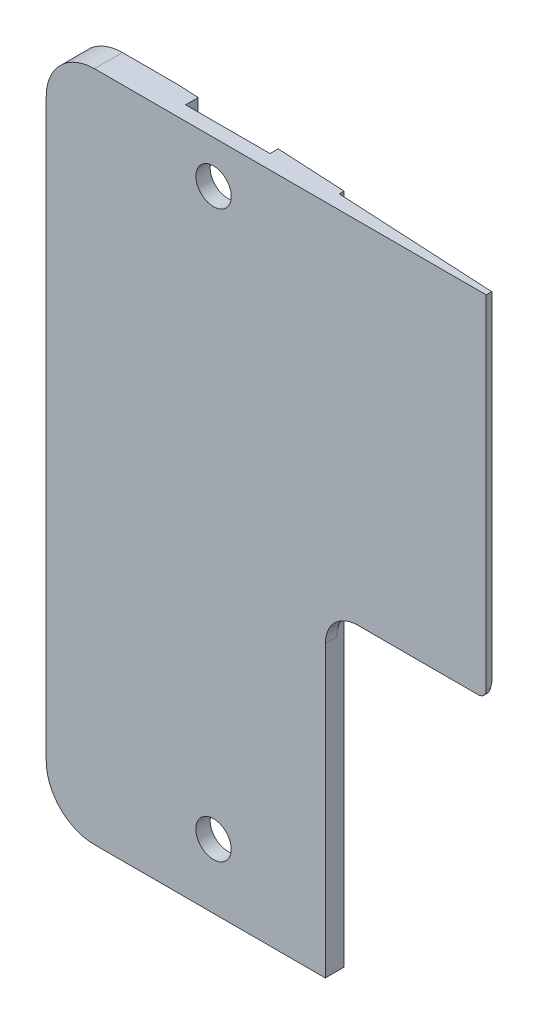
ISO-10303-21;
HEADER;
FILE_DESCRIPTION(('STEP AP214'),'2;1');
FILE_NAME('part.step','',(''),(''),'','','');
FILE_SCHEMA(('AUTOMOTIVE_DESIGN { 1 0 10303 214 1 1 1 1 }'));
ENDSEC;
DATA;
#1=APPLICATION_CONTEXT('core data for automotive mechanical design processes');
#2=APPLICATION_PROTOCOL_DEFINITION('international standard','automotive_design',2000,#1);
#3=PRODUCT_CONTEXT('',#1,'mechanical');
#4=PRODUCT('Part','Part','',(#3));
#5=PRODUCT_RELATED_PRODUCT_CATEGORY('part','',(#4));
#6=PRODUCT_DEFINITION_FORMATION('','',#4);
#7=PRODUCT_DEFINITION_CONTEXT('part definition',#1,'design');
#8=PRODUCT_DEFINITION('design','',#6,#7);
#9=PRODUCT_DEFINITION_SHAPE('','',#8);
#10=(LENGTH_UNIT() NAMED_UNIT(*) SI_UNIT(.MILLI.,.METRE.));
#11=(NAMED_UNIT(*) PLANE_ANGLE_UNIT() SI_UNIT($,.RADIAN.));
#12=(NAMED_UNIT(*) SI_UNIT($,.STERADIAN.) SOLID_ANGLE_UNIT());
#13=UNCERTAINTY_MEASURE_WITH_UNIT(LENGTH_MEASURE(1.E-05),#10,'distance_accuracy_value','');
#14=(GEOMETRIC_REPRESENTATION_CONTEXT(3) GLOBAL_UNCERTAINTY_ASSIGNED_CONTEXT((#13)) GLOBAL_UNIT_ASSIGNED_CONTEXT((#10,
#11,#12)) REPRESENTATION_CONTEXT('',''));
#15=CARTESIAN_POINT('',(0.,0.,0.));
#16=DIRECTION('',(0.,0.,1.));
#17=DIRECTION('',(1.,0.,0.));
#18=AXIS2_PLACEMENT_3D('',#15,#16,#17);
#19=CARTESIAN_POINT('',(0.,-128.652153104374,-6.7));
#20=DIRECTION('',(0.,0.,-1.));
#21=DIRECTION('',(-1.,0.,0.));
#22=AXIS2_PLACEMENT_3D('',#19,#20,#21);
#23=PLANE('',#22);
#24=CARTESIAN_POINT('',(4.64896534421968,-57.3698033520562,-6.7));
#25=DIRECTION('',(0.,0.,1.));
#26=DIRECTION('',(1.,0.,0.));
#27=AXIS2_PLACEMENT_3D('',#24,#25,#26);
#28=CIRCLE('',#27,3.);
#29=CARTESIAN_POINT('',(4.64896534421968,-54.3698033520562,-6.7));
#30=VERTEX_POINT('',#29);
#31=CARTESIAN_POINT('',(1.64896534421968,-57.3698033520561,-6.7));
#32=VERTEX_POINT('',#31);
#33=EDGE_CURVE('E202',#30,#32,#28,.T.);
#34=ORIENTED_EDGE('',*,*,#33,.F.);
#35=DIRECTION('',(-1.,0.,0.));
#36=VECTOR('',#35,1.);
#37=CARTESIAN_POINT('',(4.64896534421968,-54.3698033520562,-6.7));
#38=LINE('',#37,#36);
#39=CARTESIAN_POINT('',(8.13491967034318,-54.3698033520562,-6.70000000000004));
#40=VERTEX_POINT('',#39);
#41=EDGE_CURVE('E213',#40,#30,#38,.T.);
#42=ORIENTED_EDGE('',*,*,#41,.F.);
#43=DIRECTION('',(0.,1.,0.));
#44=VECTOR('',#43,1.);
#45=CARTESIAN_POINT('',(8.13491967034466,-128.652153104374,-6.7));
#46=LINE('',#45,#44);
#47=CARTESIAN_POINT('',(8.13491967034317,-96.15,-6.70000000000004));
#48=VERTEX_POINT('',#47);
#49=EDGE_CURVE('E245',#48,#40,#46,.T.);
#50=ORIENTED_EDGE('',*,*,#49,.F.);
#51=DIRECTION('',(1.,0.,0.));
#52=VECTOR('',#51,1.);
#53=CARTESIAN_POINT('',(4.64896534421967,-96.15,-6.7));
#54=LINE('',#53,#52);
#55=CARTESIAN_POINT('',(4.64896534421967,-96.15,-6.7));
#56=VERTEX_POINT('',#55);
#57=EDGE_CURVE('E211',#56,#48,#54,.T.);
#58=ORIENTED_EDGE('',*,*,#57,.F.);
#59=CARTESIAN_POINT('',(4.64896534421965,-93.15,-6.7));
#60=DIRECTION('',(0.,0.,1.));
#61=DIRECTION('',(-1.,0.,0.));
#62=AXIS2_PLACEMENT_3D('',#59,#60,#61);
#63=CIRCLE('',#62,3.);
#64=CARTESIAN_POINT('',(1.64896534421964,-93.15,-6.7));
#65=VERTEX_POINT('',#64);
#66=EDGE_CURVE('E208',#65,#56,#63,.T.);
#67=ORIENTED_EDGE('',*,*,#66,.F.);
#68=DIRECTION('',(0.,-1.,0.));
#69=VECTOR('',#68,1.);
#70=CARTESIAN_POINT('',(1.64896534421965,-93.15,-6.7));
#71=LINE('',#70,#69);
#72=EDGE_CURVE('E205',#32,#65,#71,.T.);
#73=ORIENTED_EDGE('',*,*,#72,.F.);
#74=EDGE_LOOP('',(#34,#42,#50,#58,#67,#73));
#75=FACE_BOUND('',#74,.T.);
#76=ADVANCED_FACE('F37',(#75),#23,.T.);
#77=CARTESIAN_POINT('',(19.,-128.652153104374,-6.13058526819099));
#78=DIRECTION('',(0.0523359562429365,0.,-0.998629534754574));
#79=DIRECTION('',(-0.998629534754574,0.,-0.0523359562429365));
#80=AXIS2_PLACEMENT_3D('',#77,#78,#79);
#81=PLANE('',#80);
#82=CARTESIAN_POINT('',(12.05,-92.15,-6.49481933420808));
#83=DIRECTION('',(0.0523359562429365,0.,-0.998629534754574));
#84=DIRECTION('',(-0.998629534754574,0.,-0.0523359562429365));
#85=AXIS2_PLACEMENT_3D('',#82,#83,#84);
#86=ELLIPSE('',#85,2.62860240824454,2.625);
#87=CARTESIAN_POINT('',(9.42500000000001,-92.15,-6.63238975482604));
#88=VERTEX_POINT('',#87);
#89=EDGE_CURVE('E201',#88,#88,#86,.T.);
#90=ORIENTED_EDGE('',*,*,#89,.F.);
#91=EDGE_LOOP('',(#90));
#92=FACE_BOUND('',#91,.T.);
#93=DIRECTION('',(0.,-1.,0.));
#94=VECTOR('',#93,1.);
#95=CARTESIAN_POINT('',(14.675,-128.652153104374,-6.35724891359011));
#96=LINE('',#95,#94);
#97=CARTESIAN_POINT('',(14.675,-54.3698033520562,-6.35724891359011));
#98=VERTEX_POINT('',#97);
#99=CARTESIAN_POINT('',(14.675,-57.,-6.35724891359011));
#100=VERTEX_POINT('',#99);
#101=EDGE_CURVE('E199',#98,#100,#96,.T.);
#102=ORIENTED_EDGE('',*,*,#101,.F.);
#103=DIRECTION('',(0.998629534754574,0.,0.0523359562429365));
#104=VECTOR('',#103,1.);
#105=CARTESIAN_POINT('',(19.,-54.3698033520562,-6.13058526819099));
#106=LINE('',#105,#104);
#107=CARTESIAN_POINT('',(19.,-54.3698033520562,-6.13058526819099));
#108=VERTEX_POINT('',#107);
#109=EDGE_CURVE('E240',#98,#108,#106,.T.);
#110=ORIENTED_EDGE('',*,*,#109,.T.);
#111=DIRECTION('',(0.,1.,0.));
#112=VECTOR('',#111,1.);
#113=CARTESIAN_POINT('',(19.,-128.652153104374,-6.13058526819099));
#114=LINE('',#113,#112);
#115=CARTESIAN_POINT('',(19.,-96.15,-6.13058526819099));
#116=VERTEX_POINT('',#115);
#117=EDGE_CURVE('E249',#116,#108,#114,.T.);
#118=ORIENTED_EDGE('',*,*,#117,.F.);
#119=DIRECTION('',(-0.998629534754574,0.,-0.0523359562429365));
#120=VECTOR('',#119,1.);
#121=CARTESIAN_POINT('',(19.,-96.15,-6.13058526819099));
#122=LINE('',#121,#120);
#123=EDGE_CURVE('E219',#116,#48,#122,.T.);
#124=ORIENTED_EDGE('',*,*,#123,.T.);
#125=ORIENTED_EDGE('',*,*,#49,.T.);
#126=CARTESIAN_POINT('',(9.42500000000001,-54.3698033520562,-6.63238975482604));
#127=VERTEX_POINT('',#126);
#128=EDGE_CURVE('E241',#40,#127,#106,.T.);
#129=ORIENTED_EDGE('',*,*,#128,.T.);
#130=DIRECTION('',(0.,1.,0.));
#131=VECTOR('',#130,1.);
#132=CARTESIAN_POINT('',(9.42500000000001,-128.652153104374,-6.63238975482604));
#133=LINE('',#132,#131);
#134=CARTESIAN_POINT('',(9.42500000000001,-57.,-6.63238975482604));
#135=VERTEX_POINT('',#134);
#136=EDGE_CURVE('E197',#135,#127,#133,.T.);
#137=ORIENTED_EDGE('',*,*,#136,.F.);
#138=CARTESIAN_POINT('',(12.05,-57.,-6.49481933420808));
#139=DIRECTION('',(0.0523359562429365,0.,-0.998629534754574));
#140=DIRECTION('',(-0.998629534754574,0.,-0.0523359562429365));
#141=AXIS2_PLACEMENT_3D('',#138,#139,#140);
#142=ELLIPSE('',#141,2.62860240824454,2.625);
#143=EDGE_CURVE('E165',#100,#135,#142,.T.);
#144=ORIENTED_EDGE('',*,*,#143,.F.);
#145=EDGE_LOOP('',(#102,#110,#118,#124,#125,#129,#137,#144));
#146=FACE_BOUND('',#145,.T.);
#147=ADVANCED_FACE('F388',(#92,#146),#81,.T.);
#148=CARTESIAN_POINT('',(19.,-128.652153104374,-6.13058526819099));
#149=DIRECTION('',(1.,0.,0.));
#150=DIRECTION('',(0.,0.,-1.));
#151=AXIS2_PLACEMENT_3D('',#148,#149,#150);
#152=PLANE('',#151);
#153=DIRECTION('',(0.,1.,0.));
#154=VECTOR('',#153,1.);
#155=CARTESIAN_POINT('',(19.,-128.652153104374,-5.83017356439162));
#156=LINE('',#155,#154);
#157=CARTESIAN_POINT('',(19.,-76.2789600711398,-5.83017356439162));
#158=VERTEX_POINT('',#157);
#159=CARTESIAN_POINT('',(19.,-54.3698033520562,-5.83017356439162));
#160=VERTEX_POINT('',#159);
#161=EDGE_CURVE('E252',#158,#160,#156,.T.);
#162=ORIENTED_EDGE('',*,*,#161,.F.);
#163=CARTESIAN_POINT('',(19.,-78.1500000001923,-5.66901754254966));
#164=CARTESIAN_POINT('',(19.0000017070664,-78.1238909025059,-5.66901732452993));
#165=CARTESIAN_POINT('',(19.0000035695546,-78.0977818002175,-5.6691189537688));
#166=CARTESIAN_POINT('',(19.0000057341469,-78.0455902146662,-5.66952589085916));
#167=CARTESIAN_POINT('',(19.0000060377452,-78.0195077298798,-5.66983100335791));
#168=CARTESIAN_POINT('',(19.0000032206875,-77.9672888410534,-5.67064578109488));
#169=CARTESIAN_POINT('',(19.0000000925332,-77.9411524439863,-5.67115589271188));
#170=CARTESIAN_POINT('',(18.9999999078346,-77.8889882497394,-5.67237537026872));
#171=CARTESIAN_POINT('',(19.0000028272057,-77.8629604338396,-5.67308393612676));
#172=CARTESIAN_POINT('',(19.0000055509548,-77.8108697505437,-5.67470328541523));
#173=CARTESIAN_POINT('',(19.0000053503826,-77.784806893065,-5.67561438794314));
#174=CARTESIAN_POINT('',(19.0000026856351,-77.7325737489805,-5.67764076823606));
#175=CARTESIAN_POINT('',(19.0000002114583,-77.7064034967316,-5.67875693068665));
#176=CARTESIAN_POINT('',(18.9999997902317,-77.6542813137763,-5.68117742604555));
#177=CARTESIAN_POINT('',(19.0000018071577,-77.6283293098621,-5.68248018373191));
#178=CARTESIAN_POINT('',(19.0000036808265,-77.5763316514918,-5.685285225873));
#179=CARTESIAN_POINT('',(19.0000035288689,-77.5502860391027,-5.68678828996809));
#180=CARTESIAN_POINT('',(19.0000017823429,-77.4980425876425,-5.68999696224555));
#181=CARTESIAN_POINT('',(19.0000001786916,-77.4718448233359,-5.69170378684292));
#182=CARTESIAN_POINT('',(18.9999998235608,-77.4197925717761,-5.69528535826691));
#183=CARTESIAN_POINT('',(19.0000010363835,-77.3939379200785,-5.69715771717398));
#184=CARTESIAN_POINT('',(19.0000021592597,-77.3420660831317,-5.70109896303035));
#185=CARTESIAN_POINT('',(19.0000020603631,-77.3160489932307,-5.70316910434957));
#186=CARTESIAN_POINT('',(19.0000010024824,-77.2638082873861,-5.70750926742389));
#187=CARTESIAN_POINT('',(19.0000000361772,-77.2375848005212,-5.70978084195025));
#188=CARTESIAN_POINT('',(18.9999999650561,-77.186047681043,-5.7144229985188));
#189=CARTESIAN_POINT('',(19.000000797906,-77.1607335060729,-5.71678756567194));
#190=CARTESIAN_POINT('',(19.000002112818,-77.1098872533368,-5.72170274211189));
#191=CARTESIAN_POINT('',(19.0000025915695,-77.0843553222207,-5.72425486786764));
#192=CARTESIAN_POINT('',(19.000002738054,-77.0330438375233,-5.72954817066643));
#193=CARTESIAN_POINT('',(19.0000023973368,-77.0072644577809,-5.73229103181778));
#194=CARTESIAN_POINT('',(19.0000016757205,-76.9554309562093,-5.73796870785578));
#195=CARTESIAN_POINT('',(19.0000012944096,-76.9293770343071,-5.74090534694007));
#196=CARTESIAN_POINT('',(19.0000006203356,-76.8769694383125,-5.74697346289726));
#197=CARTESIAN_POINT('',(19.0000003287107,-76.8506159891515,-5.75010688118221));
#198=CARTESIAN_POINT('',(19.0000002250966,-76.7975863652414,-5.75657121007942));
#199=CARTESIAN_POINT('',(19.0000004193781,-76.7709104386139,-5.75990415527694));
#200=CARTESIAN_POINT('',(18.9999996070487,-76.7192586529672,-5.76650932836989));
#201=CARTESIAN_POINT('',(18.9999986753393,-76.6942815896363,-5.76977214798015));
#202=CARTESIAN_POINT('',(18.999996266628,-76.6439958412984,-5.7764745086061));
#203=CARTESIAN_POINT('',(18.9999947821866,-76.6186874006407,-5.77991588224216));
#204=CARTESIAN_POINT('',(18.9999927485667,-76.5677247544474,-5.78697716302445));
#205=CARTESIAN_POINT('',(18.9999922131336,-76.5420708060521,-5.79059892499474));
#206=CARTESIAN_POINT('',(18.9999922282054,-76.4904043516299,-5.79802286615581));
#207=CARTESIAN_POINT('',(18.9999927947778,-76.4643921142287,-5.80182691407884));
#208=CARTESIAN_POINT('',(18.999994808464,-76.4119978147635,-5.80961717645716));
#209=CARTESIAN_POINT('',(18.9999962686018,-76.3856160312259,-5.81360526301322));
#210=CARTESIAN_POINT('',(18.9999987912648,-76.3324728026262,-5.82176537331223));
#211=CARTESIAN_POINT('',(18.9999998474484,-76.3057116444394,-5.82593926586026));
#212=CARTESIAN_POINT('',(19.0000000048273,-76.2789600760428,-5.83017356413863));
#213=B_SPLINE_CURVE_WITH_KNOTS('',3,(#163,#164,#165,#166,#167,#168,#169,#170,#171,#172,#173,
#174,#175,#176,#177,#178,#179,#180,#181,#182,#183,#184,#185,#186,#187,#188,#189,#190,#191,#192,
#193,#194,#195,#196,#197,#198,#199,#200,#201,#202,#203,#204,#205,#206,#207,#208,#209,#210,#211,
#212),.UNSPECIFIED.,.F.,.F.,(4,2,2,2,2,2,2,2,2,2,2,2,2,2,2,2,2,2,2,2,2,2,2,2,4),(0.,
0.0783271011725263,0.156579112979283,0.235002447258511,0.313114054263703,0.391349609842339,
0.469930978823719,0.547884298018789,0.626150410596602,0.704909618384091,0.782676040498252,
0.860973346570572,0.939937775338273,1.01621034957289,1.09318731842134,1.17096146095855,
1.24961765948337,1.32923440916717,1.40988393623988,1.48545141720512,1.56207510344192,
1.63979980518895,1.71866624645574,1.7987105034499,1.87996428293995),.UNSPECIFIED.);
#214=CARTESIAN_POINT('',(19.,-78.15,-5.66901679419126));
#215=VERTEX_POINT('',#214);
#216=EDGE_CURVE('E325',#158,#215,#213,.F.);
#217=ORIENTED_EDGE('',*,*,#216,.T.);
#218=DIRECTION('',(0.,0.,1.));
#219=VECTOR('',#218,1.);
#220=CARTESIAN_POINT('',(19.,-78.15,-4.96));
#221=LINE('',#220,#219);
#222=CARTESIAN_POINT('',(19.,-78.15,-4.96));
#223=VERTEX_POINT('',#222);
#224=EDGE_CURVE('E485',#215,#223,#221,.T.);
#225=ORIENTED_EDGE('',*,*,#224,.T.);
#226=DIRECTION('',(0.,1.,0.));
#227=VECTOR('',#226,1.);
#228=CARTESIAN_POINT('',(19.,-128.652153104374,-4.96));
#229=LINE('',#228,#227);
#230=CARTESIAN_POINT('',(19.,-96.15,-4.96));
#231=VERTEX_POINT('',#230);
#232=EDGE_CURVE('E473',#231,#223,#229,.T.);
#233=ORIENTED_EDGE('',*,*,#232,.F.);
#234=DIRECTION('',(0.,0.,1.));
#235=VECTOR('',#234,1.);
#236=CARTESIAN_POINT('',(19.,-96.15,-6.7));
#237=LINE('',#236,#235);
#238=EDGE_CURVE('E223',#116,#231,#237,.T.);
#239=ORIENTED_EDGE('',*,*,#238,.F.);
#240=ORIENTED_EDGE('',*,*,#117,.T.);
#241=DIRECTION('',(0.,0.,1.));
#242=VECTOR('',#241,1.);
#243=CARTESIAN_POINT('',(19.,-54.3698033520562,-6.13058526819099));
#244=LINE('',#243,#242);
#245=EDGE_CURVE('E237',#108,#160,#244,.T.);
#246=ORIENTED_EDGE('',*,*,#245,.T.);
#247=EDGE_LOOP('',(#162,#217,#225,#233,#239,#240,#246));
#248=FACE_BOUND('',#247,.T.);
#249=ADVANCED_FACE('F285',(#248),#152,.T.);
#250=CARTESIAN_POINT('',(19.,-128.652153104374,-5.83017356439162));
#251=DIRECTION('',(0.0523359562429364,0.,-0.998629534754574));
#252=DIRECTION('',(-0.998629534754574,0.,-0.0523359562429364));
#253=AXIS2_PLACEMENT_3D('',#250,#251,#252);
#254=PLANE('',#253);
#255=DIRECTION('',(-0.998629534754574,0.,-0.0523359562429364));
#256=VECTOR('',#255,1.);
#257=CARTESIAN_POINT('',(19.,-75.4035898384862,-5.83017356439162));
#258=LINE('',#257,#256);
#259=CARTESIAN_POINT('',(29.,-75.4035898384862,-5.30609577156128));
#260=VERTEX_POINT('',#259);
#261=CARTESIAN_POINT('',(21.0104671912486,-75.4035898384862,-5.72480944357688));
#262=VERTEX_POINT('',#261);
#263=EDGE_CURVE('E272',#260,#262,#258,.T.);
#264=ORIENTED_EDGE('',*,*,#263,.T.);
#265=CARTESIAN_POINT('',(18.2725232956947,-78.3654808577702,-5.8682990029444));
#266=CARTESIAN_POINT('',(18.2577001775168,-78.177322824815,-5.86907584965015));
#267=CARTESIAN_POINT('',(18.2623719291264,-77.9876397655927,-5.86883101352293));
#268=CARTESIAN_POINT('',(18.2984056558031,-77.706831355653,-5.86694256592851));
#269=CARTESIAN_POINT('',(18.3152460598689,-77.6138493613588,-5.86605999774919));
#270=CARTESIAN_POINT('',(18.358405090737,-77.4301103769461,-5.86379812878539));
#271=CARTESIAN_POINT('',(18.3847238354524,-77.3393544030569,-5.86241882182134));
#272=CARTESIAN_POINT('',(18.4465606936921,-77.1610318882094,-5.85917808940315));
#273=CARTESIAN_POINT('',(18.482078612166,-77.073465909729,-5.85731667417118));
#274=CARTESIAN_POINT('',(18.5619367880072,-76.9024530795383,-5.85313148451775));
#275=CARTESIAN_POINT('',(18.60627679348,-76.8190067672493,-5.85080772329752));
#276=CARTESIAN_POINT('',(18.7033084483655,-76.6571192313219,-5.84572250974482));
#277=CARTESIAN_POINT('',(18.7559997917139,-76.5786785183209,-5.84296107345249));
#278=CARTESIAN_POINT('',(18.869174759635,-76.4276350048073,-5.83702982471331));
#279=CARTESIAN_POINT('',(18.929658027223,-76.3550326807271,-5.83386003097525));
#280=CARTESIAN_POINT('',(19.0577747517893,-76.2164367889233,-5.82714571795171));
#281=CARTESIAN_POINT('',(19.1254078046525,-76.150443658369,-5.82360121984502));
#282=CARTESIAN_POINT('',(19.2671060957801,-76.0257668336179,-5.81617512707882));
#283=CARTESIAN_POINT('',(19.3411708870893,-75.9670835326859,-5.81229355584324));
#284=CARTESIAN_POINT('',(19.4949463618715,-75.8576494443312,-5.80423452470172));
#285=CARTESIAN_POINT('',(19.5746565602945,-75.8068990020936,-5.80005709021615));
#286=CARTESIAN_POINT('',(19.7388766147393,-75.7138694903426,-5.79145068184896));
#287=CARTESIAN_POINT('',(19.8233859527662,-75.6715907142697,-5.78702173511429));
#288=CARTESIAN_POINT('',(19.9963070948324,-75.5959534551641,-5.77795932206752));
#289=CARTESIAN_POINT('',(20.0847183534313,-75.562595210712,-5.77332588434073));
#290=CARTESIAN_POINT('',(20.2645047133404,-75.5051532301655,-5.76390368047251));
#291=CARTESIAN_POINT('',(20.3558787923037,-75.4810694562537,-5.75911496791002));
#292=CARTESIAN_POINT('',(20.632994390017,-75.4231148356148,-5.74459195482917));
#293=CARTESIAN_POINT('',(20.8217261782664,-75.4035751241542,-5.7347009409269));
#294=CARTESIAN_POINT('',(21.0104671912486,-75.4035898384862,-5.72480944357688));
#295=B_SPLINE_CURVE_WITH_KNOTS('',3,(#265,#266,#267,#268,#269,#270,#271,#272,#273,#274,#275,
#276,#277,#278,#279,#280,#281,#282,#283,#284,#285,#286,#287,#288,#289,#290,#291,#292,#293,#294),
.UNSPECIFIED.,.F.,.F.,(4,2,2,2,2,2,2,2,2,2,2,2,2,2,4),(-0.0785398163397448,0.127627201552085,
0.230710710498,0.333794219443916,0.436877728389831,0.539961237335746,0.643044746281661,
0.746128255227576,0.849211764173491,0.952295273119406,1.05537878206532,1.15846229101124,
1.26154579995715,1.36462930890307,1.5707963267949),.UNSPECIFIED.);
#296=EDGE_CURVE('E266',#262,#158,#295,.F.);
#297=ORIENTED_EDGE('',*,*,#296,.T.);
#298=ORIENTED_EDGE('',*,*,#161,.T.);
#299=DIRECTION('',(0.998629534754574,0.,0.0523359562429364));
#300=VECTOR('',#299,1.);
#301=CARTESIAN_POINT('',(19.,-54.3698033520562,-5.83017356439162));
#302=LINE('',#301,#300);
#303=CARTESIAN_POINT('',(29.,-54.3698033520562,-5.30609577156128));
#304=VERTEX_POINT('',#303);
#305=EDGE_CURVE('E234',#160,#304,#302,.T.);
#306=ORIENTED_EDGE('',*,*,#305,.T.);
#307=DIRECTION('',(0.,1.,0.));
#308=VECTOR('',#307,1.);
#309=CARTESIAN_POINT('',(29.,-128.652153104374,-5.30609577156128));
#310=LINE('',#309,#308);
#311=EDGE_CURVE('E255',#260,#304,#310,.T.);
#312=ORIENTED_EDGE('',*,*,#311,.F.);
#313=EDGE_LOOP('',(#264,#297,#298,#306,#312));
#314=FACE_BOUND('',#313,.T.);
#315=ADVANCED_FACE('F274',(#314),#254,.T.);
#316=CARTESIAN_POINT('',(29.,-128.652153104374,-4.96));
#317=DIRECTION('',(1.,0.,0.));
#318=DIRECTION('',(0.,0.,-1.));
#319=AXIS2_PLACEMENT_3D('',#316,#317,#318);
#320=PLANE('',#319);
#321=DIRECTION('',(0.,1.,0.));
#322=VECTOR('',#321,1.);
#323=CARTESIAN_POINT('',(29.,-128.652153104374,-4.96));
#324=LINE('',#323,#322);
#325=CARTESIAN_POINT('',(29.,-75.65,-4.96));
#326=VERTEX_POINT('',#325);
#327=CARTESIAN_POINT('',(29.,-54.3698033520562,-4.96));
#328=VERTEX_POINT('',#327);
#329=EDGE_CURVE('E244',#326,#328,#324,.T.);
#330=ORIENTED_EDGE('',*,*,#329,.F.);
#331=DIRECTION('',(0.,0.,1.));
#332=VECTOR('',#331,1.);
#333=CARTESIAN_POINT('',(29.,-75.65,-4.96));
#334=LINE('',#333,#332);
#335=CARTESIAN_POINT('',(29.,-75.65,-5.23997975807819));
#336=VERTEX_POINT('',#335);
#337=EDGE_CURVE('E45',#326,#336,#334,.F.);
#338=ORIENTED_EDGE('',*,*,#337,.T.);
#339=DIRECTION('',(0.,-0.965836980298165,0.25915039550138));
#340=VECTOR('',#339,1.);
#341=CARTESIAN_POINT('',(29.,-125.162663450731,8.04510517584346));
#342=LINE('',#341,#340);
#343=EDGE_CURVE('E320',#336,#260,#342,.F.);
#344=ORIENTED_EDGE('',*,*,#343,.T.);
#345=ORIENTED_EDGE('',*,*,#311,.T.);
#346=DIRECTION('',(0.,0.,1.));
#347=VECTOR('',#346,1.);
#348=CARTESIAN_POINT('',(29.,-54.3698033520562,-6.7));
#349=LINE('',#348,#347);
#350=EDGE_CURVE('E220',#304,#328,#349,.T.);
#351=ORIENTED_EDGE('',*,*,#350,.T.);
#352=EDGE_LOOP('',(#330,#338,#344,#345,#351));
#353=FACE_BOUND('',#352,.T.);
#354=ADVANCED_FACE('F284',(#353),#320,.T.);
#355=CARTESIAN_POINT('',(0.,-128.652153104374,-4.96));
#356=DIRECTION('',(0.,0.,1.));
#357=DIRECTION('',(1.,0.,0.));
#358=AXIS2_PLACEMENT_3D('',#355,#356,#357);
#359=PLANE('',#358);
#360=CARTESIAN_POINT('',(12.05,-57.,-4.96));
#361=DIRECTION('',(0.,0.,-1.));
#362=DIRECTION('',(-1.,0.,0.));
#363=AXIS2_PLACEMENT_3D('',#360,#361,#362);
#364=CIRCLE('',#363,1.1);
#365=CARTESIAN_POINT('',(10.95,-57.,-4.96));
#366=VERTEX_POINT('',#365);
#367=EDGE_CURVE('E181',#366,#366,#364,.T.);
#368=ORIENTED_EDGE('',*,*,#367,.T.);
#369=EDGE_LOOP('',(#368));
#370=FACE_BOUND('',#369,.T.);
#371=CARTESIAN_POINT('',(12.05,-92.15,-4.96));
#372=DIRECTION('',(0.,0.,-1.));
#373=DIRECTION('',(-1.,0.,0.));
#374=AXIS2_PLACEMENT_3D('',#371,#372,#373);
#375=CIRCLE('',#374,1.1);
#376=CARTESIAN_POINT('',(10.95,-92.15,-4.96));
#377=VERTEX_POINT('',#376);
#378=EDGE_CURVE('E451',#377,#377,#375,.T.);
#379=ORIENTED_EDGE('',*,*,#378,.T.);
#380=EDGE_LOOP('',(#379));
#381=FACE_BOUND('',#380,.T.);
#382=DIRECTION('',(1.,0.,0.));
#383=VECTOR('',#382,1.);
#384=CARTESIAN_POINT('',(0.,-76.15,-4.96));
#385=LINE('',#384,#383);
#386=CARTESIAN_POINT('',(21.,-76.15,-4.96));
#387=VERTEX_POINT('',#386);
#388=CARTESIAN_POINT('',(28.5,-76.15,-4.96));
#389=VERTEX_POINT('',#388);
#390=EDGE_CURVE('E466',#387,#389,#385,.T.);
#391=ORIENTED_EDGE('',*,*,#390,.T.);
#392=CARTESIAN_POINT('',(28.5,-75.65,-4.96));
#393=DIRECTION('',(0.,0.,1.));
#394=DIRECTION('',(1.,0.,0.));
#395=AXIS2_PLACEMENT_3D('',#392,#393,#394);
#396=CIRCLE('',#395,0.5);
#397=EDGE_CURVE('E59',#389,#326,#396,.T.);
#398=ORIENTED_EDGE('',*,*,#397,.T.);
#399=ORIENTED_EDGE('',*,*,#329,.T.);
#400=DIRECTION('',(-1.,0.,0.));
#401=VECTOR('',#400,1.);
#402=CARTESIAN_POINT('',(0.,-54.3698033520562,-4.96));
#403=LINE('',#402,#401);
#404=CARTESIAN_POINT('',(4.64896534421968,-54.3698033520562,-4.96));
#405=VERTEX_POINT('',#404);
#406=EDGE_CURVE('E476',#328,#405,#403,.T.);
#407=ORIENTED_EDGE('',*,*,#406,.T.);
#408=CARTESIAN_POINT('',(4.64896534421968,-57.3698033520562,-4.96));
#409=DIRECTION('',(0.,0.,1.));
#410=DIRECTION('',(1.,0.,0.));
#411=AXIS2_PLACEMENT_3D('',#408,#409,#410);
#412=CIRCLE('',#411,3.);
#413=CARTESIAN_POINT('',(1.64896534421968,-57.3698033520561,-4.96));
#414=VERTEX_POINT('',#413);
#415=EDGE_CURVE('E472',#405,#414,#412,.T.);
#416=ORIENTED_EDGE('',*,*,#415,.T.);
#417=DIRECTION('',(0.,-1.,0.));
#418=VECTOR('',#417,1.);
#419=CARTESIAN_POINT('',(1.64896534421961,-128.652153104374,-4.96));
#420=LINE('',#419,#418);
#421=CARTESIAN_POINT('',(1.64896534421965,-93.15,-4.96));
#422=VERTEX_POINT('',#421);
#423=EDGE_CURVE('E248',#414,#422,#420,.T.);
#424=ORIENTED_EDGE('',*,*,#423,.T.);
#425=CARTESIAN_POINT('',(4.64896534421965,-93.15,-4.96));
#426=DIRECTION('',(0.,0.,1.));
#427=DIRECTION('',(1.,0.,0.));
#428=AXIS2_PLACEMENT_3D('',#425,#426,#427);
#429=CIRCLE('',#428,3.);
#430=CARTESIAN_POINT('',(4.64896534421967,-96.15,-4.96));
#431=VERTEX_POINT('',#430);
#432=EDGE_CURVE('E501',#422,#431,#429,.T.);
#433=ORIENTED_EDGE('',*,*,#432,.T.);
#434=DIRECTION('',(1.,0.,0.));
#435=VECTOR('',#434,1.);
#436=CARTESIAN_POINT('',(0.,-96.15,-4.96));
#437=LINE('',#436,#435);
#438=EDGE_CURVE('E478',#431,#231,#437,.T.);
#439=ORIENTED_EDGE('',*,*,#438,.T.);
#440=ORIENTED_EDGE('',*,*,#232,.T.);
#441=CARTESIAN_POINT('',(21.,-78.15,-4.96));
#442=DIRECTION('',(0.,0.,1.));
#443=DIRECTION('',(1.,0.,0.));
#444=AXIS2_PLACEMENT_3D('',#441,#442,#443);
#445=CIRCLE('',#444,2.);
#446=EDGE_CURVE('E260',#223,#387,#445,.F.);
#447=ORIENTED_EDGE('',*,*,#446,.T.);
#448=EDGE_LOOP('',(#391,#398,#399,#407,#416,#424,#433,#439,#440,#447));
#449=FACE_BOUND('',#448,.T.);
#450=ADVANCED_FACE('F290',(#370,#381,#449),#359,.T.);
#451=CARTESIAN_POINT('',(4.64896534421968,-57.3698033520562,-6.7));
#452=DIRECTION('',(0.,0.,1.));
#453=DIRECTION('',(1.,0.,0.));
#454=AXIS2_PLACEMENT_3D('',#451,#452,#453);
#455=CYLINDRICAL_SURFACE('',#454,3.);
#456=DIRECTION('',(0.,0.,1.));
#457=VECTOR('',#456,1.);
#458=CARTESIAN_POINT('',(4.64896534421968,-54.3698033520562,-6.7));
#459=LINE('',#458,#457);
#460=EDGE_CURVE('E216',#30,#405,#459,.T.);
#461=ORIENTED_EDGE('',*,*,#460,.F.);
#462=ORIENTED_EDGE('',*,*,#33,.T.);
#463=DIRECTION('',(0.,0.,1.));
#464=VECTOR('',#463,1.);
#465=CARTESIAN_POINT('',(1.64896534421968,-57.3698033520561,-6.7));
#466=LINE('',#465,#464);
#467=EDGE_CURVE('E215',#32,#414,#466,.T.);
#468=ORIENTED_EDGE('',*,*,#467,.T.);
#469=ORIENTED_EDGE('',*,*,#415,.F.);
#470=EDGE_LOOP('',(#461,#462,#468,#469));
#471=FACE_BOUND('',#470,.T.);
#472=ADVANCED_FACE('F293',(#471),#455,.T.);
#473=CARTESIAN_POINT('',(4.64896534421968,-54.3698033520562,-6.7));
#474=DIRECTION('',(0.,1.,0.));
#475=DIRECTION('',(0.,0.,1.));
#476=AXIS2_PLACEMENT_3D('',#473,#474,#475);
#477=PLANE('',#476);
#478=DIRECTION('',(0.,0.,-1.));
#479=VECTOR('',#478,1.);
#480=CARTESIAN_POINT('',(14.675,-54.3698033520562,-5.85));
#481=LINE('',#480,#479);
#482=CARTESIAN_POINT('',(14.675,-54.3698033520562,-5.85));
#483=VERTEX_POINT('',#482);
#484=EDGE_CURVE('E194',#483,#98,#481,.T.);
#485=ORIENTED_EDGE('',*,*,#484,.F.);
#486=DIRECTION('',(1.,0.,0.));
#487=VECTOR('',#486,1.);
#488=CARTESIAN_POINT('',(9.42500000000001,-54.3698033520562,-5.85));
#489=LINE('',#488,#487);
#490=CARTESIAN_POINT('',(9.42500000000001,-54.3698033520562,-5.85));
#491=VERTEX_POINT('',#490);
#492=EDGE_CURVE('E177',#491,#483,#489,.T.);
#493=ORIENTED_EDGE('',*,*,#492,.F.);
#494=DIRECTION('',(0.,0.,-1.));
#495=VECTOR('',#494,1.);
#496=CARTESIAN_POINT('',(9.42500000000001,-54.3698033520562,-5.85));
#497=LINE('',#496,#495);
#498=EDGE_CURVE('E168',#491,#127,#497,.T.);
#499=ORIENTED_EDGE('',*,*,#498,.T.);
#500=ORIENTED_EDGE('',*,*,#128,.F.);
#501=ORIENTED_EDGE('',*,*,#41,.T.);
#502=ORIENTED_EDGE('',*,*,#460,.T.);
#503=ORIENTED_EDGE('',*,*,#406,.F.);
#504=ORIENTED_EDGE('',*,*,#350,.F.);
#505=ORIENTED_EDGE('',*,*,#305,.F.);
#506=ORIENTED_EDGE('',*,*,#245,.F.);
#507=ORIENTED_EDGE('',*,*,#109,.F.);
#508=EDGE_LOOP('',(#485,#493,#499,#500,#501,#502,#503,#504,#505,#506,#507));
#509=FACE_BOUND('',#508,.T.);
#510=ADVANCED_FACE('F399',(#509),#477,.T.);
#511=CARTESIAN_POINT('',(19.,-76.15,-6.7));
#512=DIRECTION('',(0.,-1.,0.));
#513=DIRECTION('',(0.,0.,-1.));
#514=AXIS2_PLACEMENT_3D('',#511,#512,#513);
#515=PLANE('',#514);
#516=DIRECTION('',(0.998629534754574,0.,0.0523359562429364));
#517=VECTOR('',#516,1.);
#518=CARTESIAN_POINT('',(18.9440719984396,-76.15,-5.63283015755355));
#519=LINE('',#518,#517);
#520=CARTESIAN_POINT('',(21.,-76.15,-5.52508353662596));
#521=VERTEX_POINT('',#520);
#522=CARTESIAN_POINT('',(28.5,-76.15,-5.13202519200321));
#523=VERTEX_POINT('',#522);
#524=EDGE_CURVE('E312',#521,#523,#519,.T.);
#525=ORIENTED_EDGE('',*,*,#524,.T.);
#526=DIRECTION('',(0.,0.,1.));
#527=VECTOR('',#526,1.);
#528=CARTESIAN_POINT('',(28.5,-76.15,-6.7));
#529=LINE('',#528,#527);
#530=EDGE_CURVE('E521',#523,#389,#529,.T.);
#531=ORIENTED_EDGE('',*,*,#530,.T.);
#532=ORIENTED_EDGE('',*,*,#390,.F.);
#533=DIRECTION('',(0.,0.,1.));
#534=VECTOR('',#533,1.);
#535=CARTESIAN_POINT('',(21.,-76.15,-5.83017356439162));
#536=LINE('',#535,#534);
#537=EDGE_CURVE('E491',#387,#521,#536,.F.);
#538=ORIENTED_EDGE('',*,*,#537,.T.);
#539=EDGE_LOOP('',(#525,#531,#532,#538));
#540=FACE_BOUND('',#539,.T.);
#541=ADVANCED_FACE('F412',(#540),#515,.T.);
#542=CARTESIAN_POINT('',(4.64896534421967,-96.15,-6.7));
#543=DIRECTION('',(0.,-1.,0.));
#544=DIRECTION('',(0.,0.,-1.));
#545=AXIS2_PLACEMENT_3D('',#542,#543,#544);
#546=PLANE('',#545);
#547=ORIENTED_EDGE('',*,*,#238,.T.);
#548=ORIENTED_EDGE('',*,*,#438,.F.);
#549=DIRECTION('',(0.,0.,1.));
#550=VECTOR('',#549,1.);
#551=CARTESIAN_POINT('',(4.64896534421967,-96.15,-6.7));
#552=LINE('',#551,#550);
#553=EDGE_CURVE('E225',#56,#431,#552,.T.);
#554=ORIENTED_EDGE('',*,*,#553,.F.);
#555=ORIENTED_EDGE('',*,*,#57,.T.);
#556=ORIENTED_EDGE('',*,*,#123,.F.);
#557=EDGE_LOOP('',(#547,#548,#554,#555,#556));
#558=FACE_BOUND('',#557,.T.);
#559=ADVANCED_FACE('F408',(#558),#546,.T.);
#560=CARTESIAN_POINT('',(4.64896534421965,-93.15,-6.7));
#561=DIRECTION('',(0.,0.,1.));
#562=DIRECTION('',(1.,0.,0.));
#563=AXIS2_PLACEMENT_3D('',#560,#561,#562);
#564=CYLINDRICAL_SURFACE('',#563,3.);
#565=DIRECTION('',(0.,0.,1.));
#566=VECTOR('',#565,1.);
#567=CARTESIAN_POINT('',(1.64896534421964,-93.15,-6.7));
#568=LINE('',#567,#566);
#569=EDGE_CURVE('E228',#65,#422,#568,.T.);
#570=ORIENTED_EDGE('',*,*,#569,.F.);
#571=ORIENTED_EDGE('',*,*,#66,.T.);
#572=ORIENTED_EDGE('',*,*,#553,.T.);
#573=ORIENTED_EDGE('',*,*,#432,.F.);
#574=EDGE_LOOP('',(#570,#571,#572,#573));
#575=FACE_BOUND('',#574,.T.);
#576=ADVANCED_FACE('F404',(#575),#564,.T.);
#577=CARTESIAN_POINT('',(1.64896534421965,-93.15,-6.7));
#578=DIRECTION('',(-1.,0.,0.));
#579=DIRECTION('',(0.,-1.,0.));
#580=AXIS2_PLACEMENT_3D('',#577,#578,#579);
#581=PLANE('',#580);
#582=ORIENTED_EDGE('',*,*,#467,.F.);
#583=ORIENTED_EDGE('',*,*,#72,.T.);
#584=ORIENTED_EDGE('',*,*,#569,.T.);
#585=ORIENTED_EDGE('',*,*,#423,.F.);
#586=EDGE_LOOP('',(#582,#583,#584,#585));
#587=FACE_BOUND('',#586,.T.);
#588=ADVANCED_FACE('F401',(#587),#581,.T.);
#589=CARTESIAN_POINT('',(12.05,-57.,-5.85));
#590=DIRECTION('',(0.,0.,-1.));
#591=DIRECTION('',(-1.,0.,0.));
#592=AXIS2_PLACEMENT_3D('',#589,#590,#591);
#593=CYLINDRICAL_SURFACE('',#592,2.625);
#594=ORIENTED_EDGE('',*,*,#143,.T.);
#595=DIRECTION('',(0.,0.,-1.));
#596=VECTOR('',#595,1.);
#597=CARTESIAN_POINT('',(9.42500000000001,-57.,-5.85));
#598=LINE('',#597,#596);
#599=CARTESIAN_POINT('',(9.42500000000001,-57.,-5.85));
#600=VERTEX_POINT('',#599);
#601=EDGE_CURVE('E157',#600,#135,#598,.T.);
#602=ORIENTED_EDGE('',*,*,#601,.F.);
#603=CARTESIAN_POINT('',(12.05,-57.,-5.85));
#604=DIRECTION('',(0.,0.,-1.));
#605=DIRECTION('',(-1.,0.,0.));
#606=AXIS2_PLACEMENT_3D('',#603,#604,#605);
#607=CIRCLE('',#606,2.625);
#608=CARTESIAN_POINT('',(14.675,-57.,-5.85));
#609=VERTEX_POINT('',#608);
#610=EDGE_CURVE('E162',#609,#600,#607,.T.);
#611=ORIENTED_EDGE('',*,*,#610,.F.);
#612=DIRECTION('',(0.,0.,-1.));
#613=VECTOR('',#612,1.);
#614=CARTESIAN_POINT('',(14.675,-57.,-5.85));
#615=LINE('',#614,#613);
#616=EDGE_CURVE('E192',#609,#100,#615,.T.);
#617=ORIENTED_EDGE('',*,*,#616,.T.);
#618=EDGE_LOOP('',(#594,#602,#611,#617));
#619=FACE_BOUND('',#618,.T.);
#620=ADVANCED_FACE('F159',(#619),#593,.F.);
#621=CARTESIAN_POINT('',(14.675,-57.,-5.85));
#622=DIRECTION('',(1.,0.,0.));
#623=DIRECTION('',(0.,0.,-1.));
#624=AXIS2_PLACEMENT_3D('',#621,#622,#623);
#625=PLANE('',#624);
#626=ORIENTED_EDGE('',*,*,#101,.T.);
#627=ORIENTED_EDGE('',*,*,#616,.F.);
#628=DIRECTION('',(0.,-1.,0.));
#629=VECTOR('',#628,1.);
#630=CARTESIAN_POINT('',(14.675,-57.,-5.85));
#631=LINE('',#630,#629);
#632=EDGE_CURVE('E169',#483,#609,#631,.T.);
#633=ORIENTED_EDGE('',*,*,#632,.F.);
#634=ORIENTED_EDGE('',*,*,#484,.T.);
#635=EDGE_LOOP('',(#626,#627,#633,#634));
#636=FACE_BOUND('',#635,.T.);
#637=ADVANCED_FACE('F422',(#636),#625,.F.);
#638=CARTESIAN_POINT('',(9.42500000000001,-57.,-5.85));
#639=DIRECTION('',(-1.,0.,0.));
#640=DIRECTION('',(0.,0.,1.));
#641=AXIS2_PLACEMENT_3D('',#638,#639,#640);
#642=PLANE('',#641);
#643=ORIENTED_EDGE('',*,*,#136,.T.);
#644=ORIENTED_EDGE('',*,*,#498,.F.);
#645=DIRECTION('',(0.,1.,0.));
#646=VECTOR('',#645,1.);
#647=CARTESIAN_POINT('',(9.42500000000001,-57.,-5.85));
#648=LINE('',#647,#646);
#649=EDGE_CURVE('E172',#600,#491,#648,.T.);
#650=ORIENTED_EDGE('',*,*,#649,.F.);
#651=ORIENTED_EDGE('',*,*,#601,.T.);
#652=EDGE_LOOP('',(#643,#644,#650,#651));
#653=FACE_BOUND('',#652,.T.);
#654=ADVANCED_FACE('F173',(#653),#642,.F.);
#655=CARTESIAN_POINT('',(12.05,-57.,-5.85));
#656=DIRECTION('',(0.,0.,-1.));
#657=DIRECTION('',(-1.,0.,0.));
#658=AXIS2_PLACEMENT_3D('',#655,#656,#657);
#659=PLANE('',#658);
#660=CARTESIAN_POINT('',(12.05,-57.,-5.85));
#661=DIRECTION('',(0.,0.,-1.));
#662=DIRECTION('',(-1.,0.,0.));
#663=AXIS2_PLACEMENT_3D('',#660,#661,#662);
#664=CIRCLE('',#663,1.1);
#665=CARTESIAN_POINT('',(10.95,-57.,-5.85));
#666=VERTEX_POINT('',#665);
#667=EDGE_CURVE('E184',#666,#666,#664,.T.);
#668=ORIENTED_EDGE('',*,*,#667,.F.);
#669=EDGE_LOOP('',(#668));
#670=FACE_BOUND('',#669,.T.);
#671=ORIENTED_EDGE('',*,*,#610,.T.);
#672=ORIENTED_EDGE('',*,*,#649,.T.);
#673=ORIENTED_EDGE('',*,*,#492,.T.);
#674=ORIENTED_EDGE('',*,*,#632,.T.);
#675=EDGE_LOOP('',(#671,#672,#673,#674));
#676=FACE_BOUND('',#675,.T.);
#677=ADVANCED_FACE('F179',(#670,#676),#659,.T.);
#678=CARTESIAN_POINT('',(12.05,-92.15,-5.85));
#679=DIRECTION('',(0.,0.,-1.));
#680=DIRECTION('',(-1.,0.,0.));
#681=AXIS2_PLACEMENT_3D('',#678,#679,#680);
#682=CYLINDRICAL_SURFACE('',#681,2.625);
#683=ORIENTED_EDGE('',*,*,#89,.T.);
#684=EDGE_LOOP('',(#683));
#685=FACE_BOUND('',#684,.T.);
#686=CARTESIAN_POINT('',(12.05,-92.15,-5.85));
#687=DIRECTION('',(0.,0.,-1.));
#688=DIRECTION('',(-1.,0.,0.));
#689=AXIS2_PLACEMENT_3D('',#686,#687,#688);
#690=CIRCLE('',#689,2.625);
#691=CARTESIAN_POINT('',(9.42500000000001,-92.15,-5.85));
#692=VERTEX_POINT('',#691);
#693=EDGE_CURVE('E187',#692,#692,#690,.T.);
#694=ORIENTED_EDGE('',*,*,#693,.F.);
#695=EDGE_LOOP('',(#694));
#696=FACE_BOUND('',#695,.T.);
#697=ADVANCED_FACE('F430',(#685,#696),#682,.F.);
#698=CARTESIAN_POINT('',(12.05,-92.15,-5.85));
#699=DIRECTION('',(0.,0.,-1.));
#700=DIRECTION('',(-1.,0.,0.));
#701=AXIS2_PLACEMENT_3D('',#698,#699,#700);
#702=PLANE('',#701);
#703=CARTESIAN_POINT('',(12.05,-92.15,-5.85));
#704=DIRECTION('',(0.,0.,-1.));
#705=DIRECTION('',(-1.,0.,0.));
#706=AXIS2_PLACEMENT_3D('',#703,#704,#705);
#707=CIRCLE('',#706,1.1);
#708=CARTESIAN_POINT('',(10.95,-92.15,-5.85));
#709=VERTEX_POINT('',#708);
#710=EDGE_CURVE('E454',#709,#709,#707,.T.);
#711=ORIENTED_EDGE('',*,*,#710,.F.);
#712=EDGE_LOOP('',(#711));
#713=FACE_BOUND('',#712,.T.);
#714=ORIENTED_EDGE('',*,*,#693,.T.);
#715=EDGE_LOOP('',(#714));
#716=FACE_BOUND('',#715,.T.);
#717=ADVANCED_FACE('F434',(#713,#716),#702,.T.);
#718=CARTESIAN_POINT('',(12.05,-57.,-4.96));
#719=DIRECTION('',(0.,0.,-1.));
#720=DIRECTION('',(-1.,0.,0.));
#721=AXIS2_PLACEMENT_3D('',#718,#719,#720);
#722=CYLINDRICAL_SURFACE('',#721,1.1);
#723=ORIENTED_EDGE('',*,*,#367,.F.);
#724=EDGE_LOOP('',(#723));
#725=FACE_BOUND('',#724,.T.);
#726=ORIENTED_EDGE('',*,*,#667,.T.);
#727=EDGE_LOOP('',(#726));
#728=FACE_BOUND('',#727,.T.);
#729=ADVANCED_FACE('F438',(#725,#728),#722,.F.);
#730=CARTESIAN_POINT('',(12.05,-92.15,-4.96));
#731=DIRECTION('',(0.,0.,-1.));
#732=DIRECTION('',(-1.,0.,0.));
#733=AXIS2_PLACEMENT_3D('',#730,#731,#732);
#734=CYLINDRICAL_SURFACE('',#733,1.1);
#735=ORIENTED_EDGE('',*,*,#378,.F.);
#736=EDGE_LOOP('',(#735));
#737=FACE_BOUND('',#736,.T.);
#738=ORIENTED_EDGE('',*,*,#710,.T.);
#739=EDGE_LOOP('',(#738));
#740=FACE_BOUND('',#739,.T.);
#741=ADVANCED_FACE('F300',(#737,#740),#734,.F.);
#742=CARTESIAN_POINT('',(21.,-78.15,-6.13058526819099));
#743=DIRECTION('',(0.,0.,-1.));
#744=DIRECTION('',(-1.,0.,0.));
#745=AXIS2_PLACEMENT_3D('',#742,#743,#744);
#746=CYLINDRICAL_SURFACE('',#745,2.);
#747=ORIENTED_EDGE('',*,*,#224,.F.);
#748=CARTESIAN_POINT('',(21.,-76.15,-5.52508353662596));
#749=CARTESIAN_POINT('',(20.8625543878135,-76.1499892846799,-5.53497503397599));
#750=CARTESIAN_POINT('',(20.7251154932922,-76.1642185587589,-5.5448660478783));
#751=CARTESIAN_POINT('',(20.5233134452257,-76.2064224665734,-5.55938906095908));
#752=CARTESIAN_POINT('',(20.4567727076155,-76.2239608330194,-5.5641777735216));
#753=CARTESIAN_POINT('',(20.325848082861,-76.2657914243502,-5.57359997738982));
#754=CARTESIAN_POINT('',(20.2614649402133,-76.2900836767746,-5.5782334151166));
#755=CARTESIAN_POINT('',(20.1355397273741,-76.3451644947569,-5.58729582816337));
#756=CARTESIAN_POINT('',(20.073998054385,-76.3759528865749,-5.59172477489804));
#757=CARTESIAN_POINT('',(19.9544091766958,-76.4436991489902,-5.60033118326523));
#758=CARTESIAN_POINT('',(19.8963623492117,-76.4806568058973,-5.6045086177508));
#759=CARTESIAN_POINT('',(19.7843794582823,-76.5603492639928,-5.61256764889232));
#760=CARTESIAN_POINT('',(19.7304437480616,-76.6030838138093,-5.6164492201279));
#761=CARTESIAN_POINT('',(19.6272557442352,-76.6938763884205,-5.6238753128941));
#762=CARTESIAN_POINT('',(19.5780037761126,-76.7419341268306,-5.62741981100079));
#763=CARTESIAN_POINT('',(19.4847061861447,-76.8428628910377,-5.63413412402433));
#764=CARTESIAN_POINT('',(19.4406608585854,-76.895733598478,-5.63730391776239));
#765=CARTESIAN_POINT('',(19.3582442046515,-77.0057270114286,-5.64323516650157));
#766=CARTESIAN_POINT('',(19.3198731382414,-77.0628493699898,-5.6459966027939));
#767=CARTESIAN_POINT('',(19.2492124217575,-77.1807396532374,-5.65108181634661));
#768=CARTESIAN_POINT('',(19.216922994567,-77.2415072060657,-5.65340557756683));
#769=CARTESIAN_POINT('',(19.1587684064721,-77.3660427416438,-5.65759076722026));
#770=CARTESIAN_POINT('',(19.1329034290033,-77.4298103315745,-5.65945218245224));
#771=CARTESIAN_POINT('',(19.0878723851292,-77.5596689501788,-5.66269291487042));
#772=CARTESIAN_POINT('',(19.0687064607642,-77.6257595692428,-5.66407222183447));
#773=CARTESIAN_POINT('',(19.037277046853,-77.7595625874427,-5.66633409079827));
#774=CARTESIAN_POINT('',(19.0250134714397,-77.8272742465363,-5.66721665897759));
#775=CARTESIAN_POINT('',(18.9987728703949,-78.031765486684,-5.66910510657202));
#776=CARTESIAN_POINT('',(18.9953707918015,-78.1698971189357,-5.66934994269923));
#777=CARTESIAN_POINT('',(19.0061653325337,-78.3069181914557,-5.66857309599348));
#778=B_SPLINE_CURVE_WITH_KNOTS('',3,(#748,#749,#750,#751,#752,#753,#754,#755,#756,#757,#758,
#759,#760,#761,#762,#763,#764,#765,#766,#767,#768,#769,#770,#771,#772,#773,#774,#775,#776,#777),
.UNSPECIFIED.,.F.,.F.,(4,2,2,2,2,2,2,2,2,2,2,2,2,2,4),(-0.0785398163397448,0.127627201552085,
0.230710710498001,0.333794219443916,0.436877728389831,0.539961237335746,0.643044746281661,
0.746128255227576,0.849211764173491,0.952295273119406,1.05537878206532,1.15846229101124,
1.26154579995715,1.36462930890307,1.5707963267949),.UNSPECIFIED.);
#779=EDGE_CURVE('E321',#215,#521,#778,.F.);
#780=ORIENTED_EDGE('',*,*,#779,.T.);
#781=ORIENTED_EDGE('',*,*,#537,.F.);
#782=ORIENTED_EDGE('',*,*,#446,.F.);
#783=EDGE_LOOP('',(#747,#780,#781,#782));
#784=FACE_BOUND('',#783,.T.);
#785=ADVANCED_FACE('F295',(#784),#746,.F.);
#786=CARTESIAN_POINT('',(19.,-75.4035898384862,-5.83017356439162));
#787=DIRECTION('',(-0.0505526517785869,0.25881904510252,0.96460205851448));
#788=DIRECTION('',(-0.998629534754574,0.,-0.0523359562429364));
#789=AXIS2_PLACEMENT_3D('',#786,#787,#788);
#790=PLANE('',#789);
#791=ORIENTED_EDGE('',*,*,#343,.F.);
#792=CARTESIAN_POINT('',(28.5,-75.65,-5.26618364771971));
#793=DIRECTION('',(-0.0505526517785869,0.25881904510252,0.96460205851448));
#794=DIRECTION('',(0.184912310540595,-0.946712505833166,0.263709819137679));
#795=AXIS2_PLACEMENT_3D('',#792,#793,#794);
#796=ELLIPSE('',#795,0.518348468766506,0.5);
#797=EDGE_CURVE('E12',#336,#523,#796,.F.);
#798=ORIENTED_EDGE('',*,*,#797,.T.);
#799=ORIENTED_EDGE('',*,*,#524,.F.);
#800=CARTESIAN_POINT('',(21.0104671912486,-75.4035898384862,-5.72480944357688));
#801=CARTESIAN_POINT('',(21.,-76.15,-5.52508353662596));
#802=B_SPLINE_CURVE_WITH_KNOTS('',1,(#800,#801),.UNSPECIFIED.,.F.,.F.,(2,2),(0.,1.),.UNSPECIFIED.);
#803=EDGE_CURVE('E360',#262,#521,#802,.T.);
#804=ORIENTED_EDGE('',*,*,#803,.F.);
#805=ORIENTED_EDGE('',*,*,#263,.F.);
#806=EDGE_LOOP('',(#791,#798,#799,#804,#805));
#807=FACE_BOUND('',#806,.T.);
#808=ADVANCED_FACE('F299',(#807),#790,.F.);
#809=CARTESIAN_POINT('',(19.0061653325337,-78.3069181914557,-5.66857309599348));
#810=CARTESIAN_POINT('',(18.9953707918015,-78.1698971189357,-5.66934994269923));
#811=CARTESIAN_POINT('',(18.9987728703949,-78.031765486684,-5.66910510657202));
#812=CARTESIAN_POINT('',(19.0250134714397,-77.8272742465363,-5.66721665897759));
#813=CARTESIAN_POINT('',(19.037277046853,-77.7595625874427,-5.66633409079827));
#814=CARTESIAN_POINT('',(19.0687064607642,-77.6257595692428,-5.66407222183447));
#815=CARTESIAN_POINT('',(19.0878723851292,-77.5596689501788,-5.66269291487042));
#816=CARTESIAN_POINT('',(19.1329034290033,-77.4298103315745,-5.65945218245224));
#817=CARTESIAN_POINT('',(19.1587684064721,-77.3660427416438,-5.65759076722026));
#818=CARTESIAN_POINT('',(19.216922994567,-77.2415072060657,-5.65340557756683));
#819=CARTESIAN_POINT('',(19.2492124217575,-77.1807396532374,-5.65108181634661));
#820=CARTESIAN_POINT('',(19.3198731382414,-77.0628493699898,-5.6459966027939));
#821=CARTESIAN_POINT('',(19.3582442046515,-77.0057270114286,-5.64323516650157));
#822=CARTESIAN_POINT('',(19.4406608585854,-76.895733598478,-5.63730391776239));
#823=CARTESIAN_POINT('',(19.4847061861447,-76.8428628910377,-5.63413412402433));
#824=CARTESIAN_POINT('',(19.5780037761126,-76.7419341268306,-5.62741981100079));
#825=CARTESIAN_POINT('',(19.6272557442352,-76.6938763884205,-5.6238753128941));
#826=CARTESIAN_POINT('',(19.7304437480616,-76.6030838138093,-5.6164492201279));
#827=CARTESIAN_POINT('',(19.7843794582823,-76.5603492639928,-5.61256764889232));
#828=CARTESIAN_POINT('',(19.8963623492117,-76.4806568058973,-5.6045086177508));
#829=CARTESIAN_POINT('',(19.9544091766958,-76.4436991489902,-5.60033118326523));
#830=CARTESIAN_POINT('',(20.073998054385,-76.3759528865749,-5.59172477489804));
#831=CARTESIAN_POINT('',(20.1355397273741,-76.3451644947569,-5.58729582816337));
#832=CARTESIAN_POINT('',(20.2614649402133,-76.2900836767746,-5.5782334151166));
#833=CARTESIAN_POINT('',(20.325848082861,-76.2657914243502,-5.57359997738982));
#834=CARTESIAN_POINT('',(20.4567727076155,-76.2239608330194,-5.5641777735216));
#835=CARTESIAN_POINT('',(20.5233134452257,-76.2064224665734,-5.55938906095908));
#836=CARTESIAN_POINT('',(20.7251154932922,-76.1642185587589,-5.5448660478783));
#837=CARTESIAN_POINT('',(20.8625543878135,-76.1499892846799,-5.53497503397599));
#838=CARTESIAN_POINT('',(21.,-76.15,-5.52508353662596));
#839=CARTESIAN_POINT('',(18.2725232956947,-78.3654808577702,-5.8682990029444));
#840=CARTESIAN_POINT('',(18.2577001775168,-78.177322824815,-5.86907584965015));
#841=CARTESIAN_POINT('',(18.2623719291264,-77.9876397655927,-5.86883101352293));
#842=CARTESIAN_POINT('',(18.2984056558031,-77.706831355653,-5.86694256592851));
#843=CARTESIAN_POINT('',(18.3152460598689,-77.6138493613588,-5.86605999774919));
#844=CARTESIAN_POINT('',(18.358405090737,-77.4301103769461,-5.86379812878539));
#845=CARTESIAN_POINT('',(18.3847238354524,-77.3393544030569,-5.86241882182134));
#846=CARTESIAN_POINT('',(18.4465606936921,-77.1610318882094,-5.85917808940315));
#847=CARTESIAN_POINT('',(18.482078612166,-77.073465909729,-5.85731667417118));
#848=CARTESIAN_POINT('',(18.5619367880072,-76.9024530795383,-5.85313148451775));
#849=CARTESIAN_POINT('',(18.60627679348,-76.8190067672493,-5.85080772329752));
#850=CARTESIAN_POINT('',(18.7033084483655,-76.6571192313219,-5.84572250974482));
#851=CARTESIAN_POINT('',(18.7559997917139,-76.5786785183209,-5.84296107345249));
#852=CARTESIAN_POINT('',(18.869174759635,-76.4276350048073,-5.83702982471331));
#853=CARTESIAN_POINT('',(18.929658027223,-76.3550326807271,-5.83386003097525));
#854=CARTESIAN_POINT('',(19.0577747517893,-76.2164367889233,-5.82714571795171));
#855=CARTESIAN_POINT('',(19.1254078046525,-76.150443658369,-5.82360121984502));
#856=CARTESIAN_POINT('',(19.2671060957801,-76.0257668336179,-5.81617512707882));
#857=CARTESIAN_POINT('',(19.3411708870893,-75.9670835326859,-5.81229355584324));
#858=CARTESIAN_POINT('',(19.4949463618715,-75.8576494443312,-5.80423452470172));
#859=CARTESIAN_POINT('',(19.5746565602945,-75.8068990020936,-5.80005709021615));
#860=CARTESIAN_POINT('',(19.7388766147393,-75.7138694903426,-5.79145068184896));
#861=CARTESIAN_POINT('',(19.8233859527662,-75.6715907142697,-5.78702173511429));
#862=CARTESIAN_POINT('',(19.9963070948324,-75.5959534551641,-5.77795932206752));
#863=CARTESIAN_POINT('',(20.0847183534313,-75.562595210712,-5.77332588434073));
#864=CARTESIAN_POINT('',(20.2645047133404,-75.5051532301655,-5.76390368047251));
#865=CARTESIAN_POINT('',(20.3558787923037,-75.4810694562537,-5.75911496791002));
#866=CARTESIAN_POINT('',(20.632994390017,-75.4231148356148,-5.74459195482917));
#867=CARTESIAN_POINT('',(20.8217261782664,-75.4035751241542,-5.7347009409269));
#868=CARTESIAN_POINT('',(21.0104671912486,-75.4035898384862,-5.72480944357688));
#869=B_SPLINE_SURFACE_WITH_KNOTS('',1,3,((#809,#810,#811,#812,#813,#814,#815,#816,#817,#818,
#819,#820,#821,#822,#823,#824,#825,#826,#827,#828,#829,#830,#831,#832,#833,#834,#835,#836,#837,
#838),(#839,#840,#841,#842,#843,#844,#845,#846,#847,#848,#849,#850,#851,#852,#853,#854,#855,
#856,#857,#858,#859,#860,#861,#862,#863,#864,#865,#866,#867,#868)),.UNSPECIFIED.,.F.,.F.,.F.,(2,
2),(4,2,2,2,2,2,2,2,2,2,2,2,2,2,4),(0.,1.),(-0.0785398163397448,0.127627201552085,
0.230710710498,0.333794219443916,0.436877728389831,0.539961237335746,0.643044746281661,
0.746128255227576,0.849211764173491,0.952295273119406,1.05537878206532,1.15846229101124,
1.26154579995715,1.36462930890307,1.5707963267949),.UNSPECIFIED.);
#870=ORIENTED_EDGE('',*,*,#803,.T.);
#871=ORIENTED_EDGE('',*,*,#779,.F.);
#872=ORIENTED_EDGE('',*,*,#216,.F.);
#873=ORIENTED_EDGE('',*,*,#296,.F.);
#874=EDGE_LOOP('',(#870,#871,#872,#873));
#875=FACE_BOUND('',#874,.T.);
#876=ADVANCED_FACE('F302',(#875),#869,.T.);
#877=CARTESIAN_POINT('',(28.5,-75.65,-6.7));
#878=DIRECTION('',(0.,0.,1.));
#879=DIRECTION('',(1.,0.,0.));
#880=AXIS2_PLACEMENT_3D('',#877,#878,#879);
#881=CYLINDRICAL_SURFACE('',#880,0.5);
#882=ORIENTED_EDGE('',*,*,#797,.F.);
#883=ORIENTED_EDGE('',*,*,#337,.F.);
#884=ORIENTED_EDGE('',*,*,#397,.F.);
#885=ORIENTED_EDGE('',*,*,#530,.F.);
#886=EDGE_LOOP('',(#882,#883,#884,#885));
#887=FACE_BOUND('',#886,.T.);
#888=ADVANCED_FACE('F39',(#887),#881,.T.);
#889=CLOSED_SHELL('',(#76,#147,#249,#315,#354,#450,#472,#510,#541,#559,#576,#588,#620,#637,#654,
#677,#697,#717,#729,#741,#785,#808,#876,#888));
#890=MANIFOLD_SOLID_BREP('B2',#889);
#891=ADVANCED_BREP_SHAPE_REPRESENTATION('',(#18,#890),#14);
#892=SHAPE_DEFINITION_REPRESENTATION(#9,#891);
ENDSEC;
END-ISO-10303-21;
